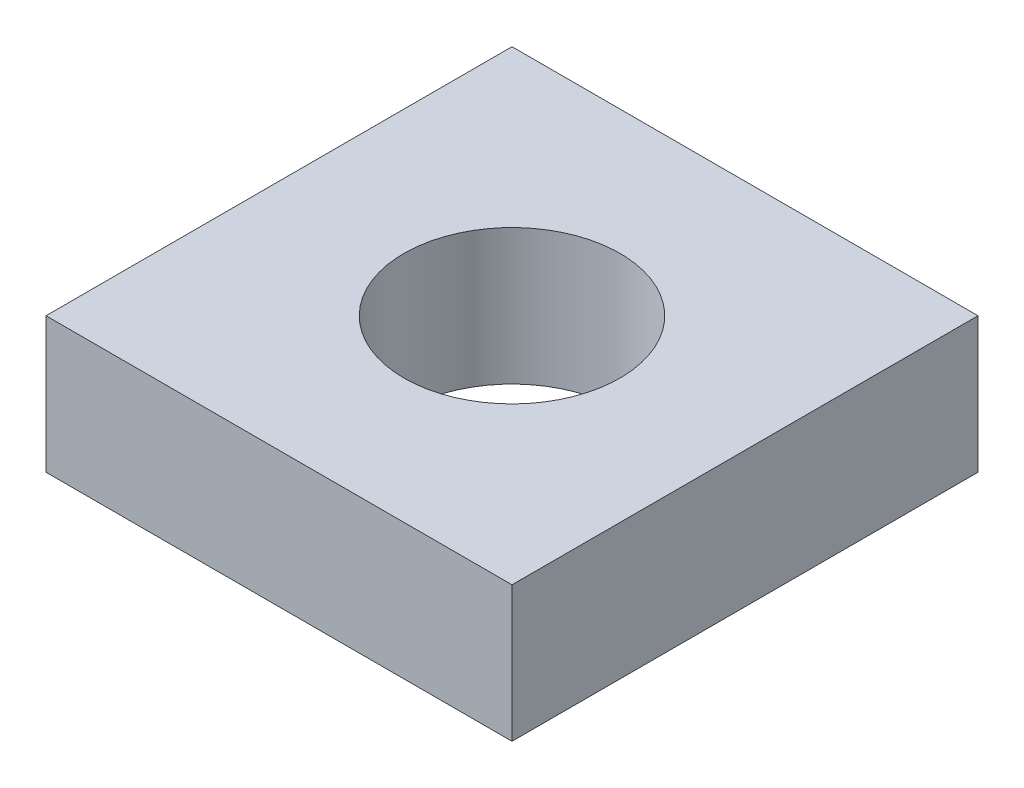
ISO-10303-21;
HEADER;
FILE_DESCRIPTION(('STEP AP214'),'2;1');
FILE_NAME('part.step','',(''),(''),'','','');
FILE_SCHEMA(('AUTOMOTIVE_DESIGN { 1 0 10303 214 1 1 1 1 }'));
ENDSEC;
DATA;
#1=APPLICATION_CONTEXT('core data for automotive mechanical design processes');
#2=APPLICATION_PROTOCOL_DEFINITION('international standard','automotive_design',2000,#1);
#3=PRODUCT_CONTEXT('',#1,'mechanical');
#4=PRODUCT('Part','Part','',(#3));
#5=PRODUCT_RELATED_PRODUCT_CATEGORY('part','',(#4));
#6=PRODUCT_DEFINITION_FORMATION('','',#4);
#7=PRODUCT_DEFINITION_CONTEXT('part definition',#1,'design');
#8=PRODUCT_DEFINITION('design','',#6,#7);
#9=PRODUCT_DEFINITION_SHAPE('','',#8);
#10=(LENGTH_UNIT() NAMED_UNIT(*) SI_UNIT(.MILLI.,.METRE.));
#11=(NAMED_UNIT(*) PLANE_ANGLE_UNIT() SI_UNIT($,.RADIAN.));
#12=(NAMED_UNIT(*) SI_UNIT($,.STERADIAN.) SOLID_ANGLE_UNIT());
#13=UNCERTAINTY_MEASURE_WITH_UNIT(LENGTH_MEASURE(1.E-05),#10,'distance_accuracy_value','');
#14=(GEOMETRIC_REPRESENTATION_CONTEXT(3) GLOBAL_UNCERTAINTY_ASSIGNED_CONTEXT((#13)) GLOBAL_UNIT_ASSIGNED_CONTEXT((#10,
#11,#12)) REPRESENTATION_CONTEXT('',''));
#15=CARTESIAN_POINT('',(0.,0.,0.));
#16=DIRECTION('',(0.,0.,1.));
#17=DIRECTION('',(1.,0.,0.));
#18=AXIS2_PLACEMENT_3D('',#15,#16,#17);
#19=CARTESIAN_POINT('',(0.,0.8,0.));
#20=DIRECTION('',(0.,1.,0.));
#21=DIRECTION('',(0.,0.,1.));
#22=AXIS2_PLACEMENT_3D('',#19,#20,#21);
#23=PLANE('',#22);
#24=CARTESIAN_POINT('',(0.,0.8,0.));
#25=DIRECTION('',(0.,1.,0.));
#26=DIRECTION('',(0.,0.,1.));
#27=AXIS2_PLACEMENT_3D('',#24,#25,#26);
#28=CIRCLE('',#27,1.275);
#29=CARTESIAN_POINT('',(0.,0.8,1.275));
#30=VERTEX_POINT('',#29);
#31=EDGE_CURVE('P0_E20',#30,#30,#28,.F.);
#32=ORIENTED_EDGE('',*,*,#31,.T.);
#33=EDGE_LOOP('',(#32));
#34=FACE_BOUND('',#33,.T.);
#35=DIRECTION('',(0.,0.,1.));
#36=VECTOR('',#35,1.);
#37=CARTESIAN_POINT('',(-2.75,0.8,-2.75));
#38=LINE('',#37,#36);
#39=CARTESIAN_POINT('',(-2.75,0.8,2.75));
#40=VERTEX_POINT('',#39);
#41=CARTESIAN_POINT('',(-2.75,0.8,-2.75));
#42=VERTEX_POINT('',#41);
#43=EDGE_CURVE('P0_E70',#40,#42,#38,.F.);
#44=ORIENTED_EDGE('',*,*,#43,.F.);
#45=DIRECTION('',(1.,0.,0.));
#46=VECTOR('',#45,1.);
#47=CARTESIAN_POINT('',(-2.75,0.8,2.75));
#48=LINE('',#47,#46);
#49=CARTESIAN_POINT('',(2.75,0.8,2.75));
#50=VERTEX_POINT('',#49);
#51=EDGE_CURVE('P0_E67',#50,#40,#48,.F.);
#52=ORIENTED_EDGE('',*,*,#51,.F.);
#53=DIRECTION('',(0.,0.,-1.));
#54=VECTOR('',#53,1.);
#55=CARTESIAN_POINT('',(2.75,0.8,2.75));
#56=LINE('',#55,#54);
#57=CARTESIAN_POINT('',(2.75,0.8,-2.75));
#58=VERTEX_POINT('',#57);
#59=EDGE_CURVE('P0_E58',#58,#50,#56,.F.);
#60=ORIENTED_EDGE('',*,*,#59,.F.);
#61=DIRECTION('',(-1.,0.,0.));
#62=VECTOR('',#61,1.);
#63=CARTESIAN_POINT('',(2.75,0.8,-2.75));
#64=LINE('',#63,#62);
#65=EDGE_CURVE('P0_E53',#42,#58,#64,.F.);
#66=ORIENTED_EDGE('',*,*,#65,.F.);
#67=EDGE_LOOP('',(#44,#52,#60,#66));
#68=FACE_BOUND('',#67,.T.);
#69=ADVANCED_FACE('P0_F17',(#34,#68),#23,.T.);
#70=CARTESIAN_POINT('',(-2.75,-0.8,2.75));
#71=DIRECTION('',(0.,0.,1.));
#72=DIRECTION('',(1.,0.,0.));
#73=AXIS2_PLACEMENT_3D('',#70,#71,#72);
#74=PLANE('',#73);
#75=DIRECTION('',(0.,1.,0.));
#76=VECTOR('',#75,1.);
#77=CARTESIAN_POINT('',(-2.75,-0.8,2.75));
#78=LINE('',#77,#76);
#79=CARTESIAN_POINT('',(-2.75,-0.8,2.75));
#80=VERTEX_POINT('',#79);
#81=EDGE_CURVE('P0_E82',#80,#40,#78,.T.);
#82=ORIENTED_EDGE('',*,*,#81,.F.);
#83=DIRECTION('',(1.,0.,0.));
#84=VECTOR('',#83,1.);
#85=CARTESIAN_POINT('',(0.,-0.8,2.75));
#86=LINE('',#85,#84);
#87=CARTESIAN_POINT('',(2.75,-0.8,2.75));
#88=VERTEX_POINT('',#87);
#89=EDGE_CURVE('P0_E77',#80,#88,#86,.T.);
#90=ORIENTED_EDGE('',*,*,#89,.T.);
#91=DIRECTION('',(0.,1.,0.));
#92=VECTOR('',#91,1.);
#93=CARTESIAN_POINT('',(2.75,-0.8,2.75));
#94=LINE('',#93,#92);
#95=EDGE_CURVE('P0_E63',#50,#88,#94,.F.);
#96=ORIENTED_EDGE('',*,*,#95,.F.);
#97=ORIENTED_EDGE('',*,*,#51,.T.);
#98=EDGE_LOOP('',(#82,#90,#96,#97));
#99=FACE_BOUND('',#98,.T.);
#100=ADVANCED_FACE('P0_F76',(#99),#74,.T.);
#101=CARTESIAN_POINT('',(2.75,-0.8,2.75));
#102=DIRECTION('',(1.,0.,0.));
#103=DIRECTION('',(0.,0.,-1.));
#104=AXIS2_PLACEMENT_3D('',#101,#102,#103);
#105=PLANE('',#104);
#106=ORIENTED_EDGE('',*,*,#95,.T.);
#107=DIRECTION('',(0.,0.,1.));
#108=VECTOR('',#107,1.);
#109=CARTESIAN_POINT('',(2.75,-0.8,0.));
#110=LINE('',#109,#108);
#111=CARTESIAN_POINT('',(2.75,-0.8,-2.75));
#112=VERTEX_POINT('',#111);
#113=EDGE_CURVE('P0_E87',#88,#112,#110,.F.);
#114=ORIENTED_EDGE('',*,*,#113,.T.);
#115=DIRECTION('',(0.,1.,0.));
#116=VECTOR('',#115,1.);
#117=CARTESIAN_POINT('',(2.75,-0.8,-2.75));
#118=LINE('',#117,#116);
#119=EDGE_CURVE('P0_E65',#58,#112,#118,.F.);
#120=ORIENTED_EDGE('',*,*,#119,.F.);
#121=ORIENTED_EDGE('',*,*,#59,.T.);
#122=EDGE_LOOP('',(#106,#114,#120,#121));
#123=FACE_BOUND('',#122,.T.);
#124=ADVANCED_FACE('P0_F60',(#123),#105,.T.);
#125=CARTESIAN_POINT('',(2.75,-0.8,-2.75));
#126=DIRECTION('',(0.,0.,-1.));
#127=DIRECTION('',(-1.,0.,0.));
#128=AXIS2_PLACEMENT_3D('',#125,#126,#127);
#129=PLANE('',#128);
#130=ORIENTED_EDGE('',*,*,#119,.T.);
#131=DIRECTION('',(1.,0.,0.));
#132=VECTOR('',#131,1.);
#133=CARTESIAN_POINT('',(0.,-0.8,-2.75));
#134=LINE('',#133,#132);
#135=CARTESIAN_POINT('',(-2.75,-0.8,-2.75));
#136=VERTEX_POINT('',#135);
#137=EDGE_CURVE('P0_E89',#112,#136,#134,.F.);
#138=ORIENTED_EDGE('',*,*,#137,.T.);
#139=DIRECTION('',(0.,1.,0.));
#140=VECTOR('',#139,1.);
#141=CARTESIAN_POINT('',(-2.75,-0.8,-2.75));
#142=LINE('',#141,#140);
#143=EDGE_CURVE('P0_E34',#42,#136,#142,.F.);
#144=ORIENTED_EDGE('',*,*,#143,.F.);
#145=ORIENTED_EDGE('',*,*,#65,.T.);
#146=EDGE_LOOP('',(#130,#138,#144,#145));
#147=FACE_BOUND('',#146,.T.);
#148=ADVANCED_FACE('P0_F96',(#147),#129,.T.);
#149=CARTESIAN_POINT('',(-2.75,-0.8,-2.75));
#150=DIRECTION('',(-1.,0.,0.));
#151=DIRECTION('',(0.,0.,1.));
#152=AXIS2_PLACEMENT_3D('',#149,#150,#151);
#153=PLANE('',#152);
#154=ORIENTED_EDGE('',*,*,#143,.T.);
#155=DIRECTION('',(0.,0.,1.));
#156=VECTOR('',#155,1.);
#157=CARTESIAN_POINT('',(-2.75,-0.8,0.));
#158=LINE('',#157,#156);
#159=EDGE_CURVE('P0_E26',#136,#80,#158,.T.);
#160=ORIENTED_EDGE('',*,*,#159,.T.);
#161=ORIENTED_EDGE('',*,*,#81,.T.);
#162=ORIENTED_EDGE('',*,*,#43,.T.);
#163=EDGE_LOOP('',(#154,#160,#161,#162));
#164=FACE_BOUND('',#163,.T.);
#165=ADVANCED_FACE('P0_F92',(#164),#153,.T.);
#166=CARTESIAN_POINT('',(0.,-0.8,0.));
#167=DIRECTION('',(0.,1.,0.));
#168=DIRECTION('',(0.,0.,1.));
#169=AXIS2_PLACEMENT_3D('',#166,#167,#168);
#170=CYLINDRICAL_SURFACE('',#169,1.275);
#171=ORIENTED_EDGE('',*,*,#31,.F.);
#172=EDGE_LOOP('',(#171));
#173=FACE_BOUND('',#172,.T.);
#174=CARTESIAN_POINT('',(0.,-0.8,0.));
#175=DIRECTION('',(0.,1.,0.));
#176=DIRECTION('',(0.,0.,1.));
#177=AXIS2_PLACEMENT_3D('',#174,#175,#176);
#178=CIRCLE('',#177,1.275);
#179=CARTESIAN_POINT('',(0.,-0.8,1.275));
#180=VERTEX_POINT('',#179);
#181=EDGE_CURVE('P0_E11',#180,#180,#178,.F.);
#182=ORIENTED_EDGE('',*,*,#181,.T.);
#183=EDGE_LOOP('',(#182));
#184=FACE_BOUND('',#183,.T.);
#185=ADVANCED_FACE('P0_F104',(#173,#184),#170,.F.);
#186=CARTESIAN_POINT('',(0.,-0.8,0.));
#187=DIRECTION('',(0.,1.,0.));
#188=DIRECTION('',(0.,0.,1.));
#189=AXIS2_PLACEMENT_3D('',#186,#187,#188);
#190=PLANE('',#189);
#191=ORIENTED_EDGE('',*,*,#181,.F.);
#192=EDGE_LOOP('',(#191));
#193=FACE_BOUND('',#192,.T.);
#194=ORIENTED_EDGE('',*,*,#137,.F.);
#195=ORIENTED_EDGE('',*,*,#113,.F.);
#196=ORIENTED_EDGE('',*,*,#89,.F.);
#197=ORIENTED_EDGE('',*,*,#159,.F.);
#198=EDGE_LOOP('',(#194,#195,#196,#197));
#199=FACE_BOUND('',#198,.T.);
#200=ADVANCED_FACE('P0_F95',(#193,#199),#190,.F.);
#201=CLOSED_SHELL('',(#69,#100,#124,#148,#165,#185,#200));
#202=MANIFOLD_SOLID_BREP('P0_B1',#201);
#203=CARTESIAN_POINT('',(0.,0.8,0.));
#204=DIRECTION('',(0.,-1.,0.));
#205=DIRECTION('',(0.,0.,-1.));
#206=AXIS2_PLACEMENT_3D('',#203,#204,#205);
#207=CYLINDRICAL_SURFACE('',#206,1.5);
#208=CARTESIAN_POINT('',(0.,-0.8,0.));
#209=DIRECTION('',(0.,-1.,0.));
#210=DIRECTION('',(0.,0.,-1.));
#211=AXIS2_PLACEMENT_3D('',#208,#209,#210);
#212=CIRCLE('',#211,1.5);
#213=CARTESIAN_POINT('',(0.,-0.8,-1.5));
#214=VERTEX_POINT('',#213);
#215=EDGE_CURVE('P1_E16',#214,#214,#212,.F.);
#216=ORIENTED_EDGE('',*,*,#215,.T.);
#217=EDGE_LOOP('',(#216));
#218=FACE_BOUND('',#217,.T.);
#219=CARTESIAN_POINT('',(0.,0.8,0.));
#220=DIRECTION('',(0.,-1.,0.));
#221=DIRECTION('',(0.,0.,-1.));
#222=AXIS2_PLACEMENT_3D('',#219,#220,#221);
#223=CIRCLE('',#222,1.5);
#224=CARTESIAN_POINT('',(0.,0.8,-1.5));
#225=VERTEX_POINT('',#224);
#226=EDGE_CURVE('P1_E10',#225,#225,#223,.T.);
#227=ORIENTED_EDGE('',*,*,#226,.T.);
#228=EDGE_LOOP('',(#227));
#229=FACE_BOUND('',#228,.T.);
#230=ADVANCED_FACE('P1_F15',(#218,#229),#207,.T.);
#231=OPEN_SHELL('',(#230));
#232=SHELL_BASED_SURFACE_MODEL('P1_B1',(#231));
#233=ADVANCED_BREP_SHAPE_REPRESENTATION('',(#18,#202),#14);
#234=MANIFOLD_SURFACE_SHAPE_REPRESENTATION('',(#18,#232),#14);
#235=SHAPE_REPRESENTATION('',(#18),#14);
#236=SHAPE_DEFINITION_REPRESENTATION(#9,#235);
#237=SHAPE_REPRESENTATION_RELATIONSHIP('','',#235,#233);
#238=SHAPE_REPRESENTATION_RELATIONSHIP('','',#235,#234);
ENDSEC;
END-ISO-10303-21;
